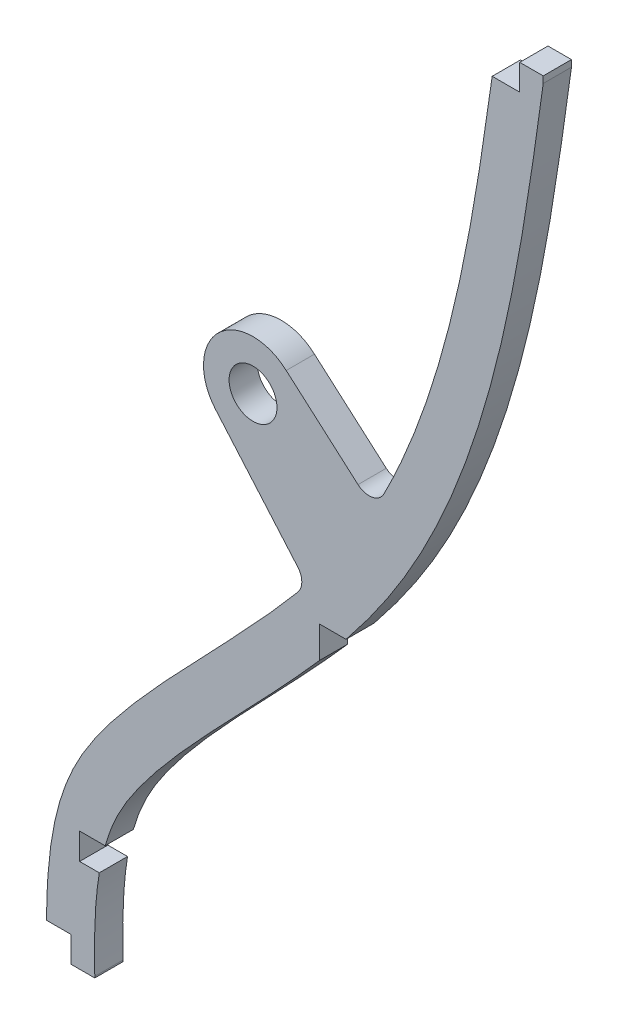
ISO-10303-21;
HEADER;
FILE_DESCRIPTION(('STEP AP214'),'2;1');
FILE_NAME('part.step','',(''),(''),'','','');
FILE_SCHEMA(('AUTOMOTIVE_DESIGN { 1 0 10303 214 1 1 1 1 }'));
ENDSEC;
DATA;
#1=APPLICATION_CONTEXT('core data for automotive mechanical design processes');
#2=APPLICATION_PROTOCOL_DEFINITION('international standard','automotive_design',2000,#1);
#3=PRODUCT_CONTEXT('',#1,'mechanical');
#4=PRODUCT('Part','Part','',(#3));
#5=PRODUCT_RELATED_PRODUCT_CATEGORY('part','',(#4));
#6=PRODUCT_DEFINITION_FORMATION('','',#4);
#7=PRODUCT_DEFINITION_CONTEXT('part definition',#1,'design');
#8=PRODUCT_DEFINITION('design','',#6,#7);
#9=PRODUCT_DEFINITION_SHAPE('','',#8);
#10=(LENGTH_UNIT() NAMED_UNIT(*) SI_UNIT(.MILLI.,.METRE.));
#11=(NAMED_UNIT(*) PLANE_ANGLE_UNIT() SI_UNIT($,.RADIAN.));
#12=(NAMED_UNIT(*) SI_UNIT($,.STERADIAN.) SOLID_ANGLE_UNIT());
#13=UNCERTAINTY_MEASURE_WITH_UNIT(LENGTH_MEASURE(1.E-05),#10,'distance_accuracy_value','');
#14=(GEOMETRIC_REPRESENTATION_CONTEXT(3) GLOBAL_UNCERTAINTY_ASSIGNED_CONTEXT((#13)) GLOBAL_UNIT_ASSIGNED_CONTEXT((#10,
#11,#12)) REPRESENTATION_CONTEXT('',''));
#15=CARTESIAN_POINT('',(0.,0.,0.));
#16=DIRECTION('',(0.,0.,1.));
#17=DIRECTION('',(1.,0.,0.));
#18=AXIS2_PLACEMENT_3D('',#15,#16,#17);
#19=CARTESIAN_POINT('',(-28.575,106.68,2.9972));
#20=CARTESIAN_POINT('',(-31.1223322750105,88.3122925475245,2.9972));
#21=CARTESIAN_POINT('',(-35.6949869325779,54.9592886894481,2.9972));
#22=CARTESIAN_POINT('',(-70.4253531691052,26.7634785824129,2.9972));
#23=CARTESIAN_POINT('',(-76.5696549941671,12.326423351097,2.9972));
#24=CARTESIAN_POINT('',(-76.2,0.,2.9972));
#25=B_SPLINE_CURVE_WITH_KNOTS('',3,(#19,#20,#21,#22,#23,#24),.UNSPECIFIED.,.F.,.F.,(4,1,1,4),
(0.,0.473853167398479,0.807071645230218,1.),.UNSPECIFIED.);
#26=DIRECTION('',(0.,0.,-1.));
#27=VECTOR('',#26,1.);
#28=SURFACE_OF_LINEAR_EXTRUSION('',#25,#27);
#29=CARTESIAN_POINT('',(-28.575,106.68,0.));
#30=CARTESIAN_POINT('',(-31.1223322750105,88.3122925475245,0.));
#31=CARTESIAN_POINT('',(-35.6949869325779,54.9592886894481,0.));
#32=CARTESIAN_POINT('',(-70.4253531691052,26.7634785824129,0.));
#33=CARTESIAN_POINT('',(-76.5696549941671,12.326423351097,0.));
#34=CARTESIAN_POINT('',(-76.2,0.,0.));
#35=B_SPLINE_CURVE_WITH_KNOTS('',3,(#29,#30,#31,#32,#33,#34),.UNSPECIFIED.,.F.,.F.,(4,1,1,4),
(0.,0.473853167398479,0.807071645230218,1.),.UNSPECIFIED.);
#36=CARTESIAN_POINT('',(-28.9562663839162,103.9368,0.));
#37=VERTEX_POINT('',#36);
#38=CARTESIAN_POINT('',(-40.4376055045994,59.8291686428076,0.));
#39=VERTEX_POINT('',#38);
#40=EDGE_CURVE('E351',#37,#39,#35,.T.);
#41=ORIENTED_EDGE('',*,*,#40,.T.);
#42=DIRECTION('',(0.,0.,-1.));
#43=VECTOR('',#42,1.);
#44=CARTESIAN_POINT('',(-40.4376055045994,59.8291686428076,0.));
#45=LINE('',#44,#43);
#46=CARTESIAN_POINT('',(-40.4376055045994,59.8291686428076,2.9972));
#47=VERTEX_POINT('',#46);
#48=EDGE_CURVE('E354',#39,#47,#45,.F.);
#49=ORIENTED_EDGE('',*,*,#48,.T.);
#50=CARTESIAN_POINT('',(-28.9562663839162,103.9368,2.9972));
#51=VERTEX_POINT('',#50);
#52=EDGE_CURVE('E306',#51,#47,#25,.T.);
#53=ORIENTED_EDGE('',*,*,#52,.F.);
#54=DIRECTION('',(0.,0.,1.));
#55=VECTOR('',#54,1.);
#56=CARTESIAN_POINT('',(-28.9562663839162,103.9368,0.));
#57=LINE('',#56,#55);
#58=EDGE_CURVE('E232',#37,#51,#57,.T.);
#59=ORIENTED_EDGE('',*,*,#58,.F.);
#60=EDGE_LOOP('',(#41,#49,#53,#59));
#61=FACE_BOUND('',#60,.T.);
#62=ADVANCED_FACE('F33',(#61),#28,.F.);
#63=CARTESIAN_POINT('',(-71.12228275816,0.152274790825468,2.9972));
#64=CARTESIAN_POINT('',(-71.1360709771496,0.612053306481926,2.9972));
#65=CARTESIAN_POINT('',(-71.1567058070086,1.54979316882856,2.9972));
#66=CARTESIAN_POINT('',(-71.1645984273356,3.28211812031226,2.9972));
#67=CARTESIAN_POINT('',(-71.1167972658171,5.2861742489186,2.9972));
#68=CARTESIAN_POINT('',(-70.9730711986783,7.42161548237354,2.9972));
#69=CARTESIAN_POINT('',(-70.6767068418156,9.95097976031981,2.9972));
#70=CARTESIAN_POINT('',(-70.1305550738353,12.5718264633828,2.9972));
#71=CARTESIAN_POINT('',(-69.2453812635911,15.104636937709,2.9972));
#72=CARTESIAN_POINT('',(-68.1202374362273,17.3343932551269,2.9972));
#73=CARTESIAN_POINT('',(-66.672184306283,19.5510756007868,2.9972));
#74=CARTESIAN_POINT('',(-64.8630643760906,21.9349302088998,2.9972));
#75=CARTESIAN_POINT('',(-62.1184326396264,25.2082421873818,2.9972));
#76=CARTESIAN_POINT('',(-58.1371910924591,29.5028468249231,2.9972));
#77=CARTESIAN_POINT('',(-52.8597313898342,34.9642275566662,2.9972));
#78=CARTESIAN_POINT('',(-47.4482093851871,40.7915416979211,2.9972));
#79=CARTESIAN_POINT('',(-42.2515146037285,47.0604507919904,2.9972));
#80=CARTESIAN_POINT('',(-37.6918324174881,53.925317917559,2.9972));
#81=CARTESIAN_POINT('',(-34.0642333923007,61.0843459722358,2.9972));
#82=CARTESIAN_POINT('',(-31.169794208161,68.4657942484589,2.9972));
#83=CARTESIAN_POINT('',(-28.9001236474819,75.9824768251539,2.9972));
#84=CARTESIAN_POINT('',(-27.1227122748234,83.5631378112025,2.9972));
#85=CARTESIAN_POINT('',(-25.7154204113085,91.1411224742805,2.9972));
#86=CARTESIAN_POINT('',(-24.7522109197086,97.3940158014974,2.9972));
#87=CARTESIAN_POINT('',(-24.0485885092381,102.335722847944,2.9972));
#88=CARTESIAN_POINT('',(-23.7122461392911,104.762949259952,2.9972));
#89=CARTESIAN_POINT('',(-23.5431598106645,105.98215738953,2.9972));
#90=B_SPLINE_CURVE_WITH_KNOTS('',3,(#63,#64,#65,#66,#67,#68,#69,#70,#71,#72,#73,#74,#75,#76,#77,
#78,#79,#80,#81,#82,#83,#84,#85,#86,#87,#88,#89),.UNSPECIFIED.,.F.,.F.,(4,1,1,1,1,1,1,1,1,1,1,1,
1,1,1,1,1,1,1,1,1,1,1,1,4),(0.,0.0078125,0.015625,0.03125,0.046875,0.0625,0.09375,0.125,0.15625,
0.1875,0.21875,0.25,0.3125,0.375,0.4375,0.5,0.5625,0.625,0.6875,0.75,0.8125,0.875,0.9375,
0.96875,1.),.UNSPECIFIED.);
#91=DIRECTION('',(0.,0.,-1.));
#92=VECTOR('',#91,1.);
#93=SURFACE_OF_LINEAR_EXTRUSION('',#90,#92);
#94=CARTESIAN_POINT('',(-71.12228275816,0.152274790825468,0.));
#95=CARTESIAN_POINT('',(-71.1360709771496,0.612053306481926,0.));
#96=CARTESIAN_POINT('',(-71.1567058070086,1.54979316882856,0.));
#97=CARTESIAN_POINT('',(-71.1645984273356,3.28211812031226,0.));
#98=CARTESIAN_POINT('',(-71.1167972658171,5.2861742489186,0.));
#99=CARTESIAN_POINT('',(-70.9730711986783,7.42161548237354,0.));
#100=CARTESIAN_POINT('',(-70.6767068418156,9.95097976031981,0.));
#101=CARTESIAN_POINT('',(-70.1305550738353,12.5718264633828,0.));
#102=CARTESIAN_POINT('',(-69.2453812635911,15.104636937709,0.));
#103=CARTESIAN_POINT('',(-68.1202374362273,17.3343932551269,0.));
#104=CARTESIAN_POINT('',(-66.672184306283,19.5510756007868,0.));
#105=CARTESIAN_POINT('',(-64.8630643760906,21.9349302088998,0.));
#106=CARTESIAN_POINT('',(-62.1184326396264,25.2082421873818,0.));
#107=CARTESIAN_POINT('',(-58.1371910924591,29.5028468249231,0.));
#108=CARTESIAN_POINT('',(-52.8597313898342,34.9642275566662,0.));
#109=CARTESIAN_POINT('',(-47.4482093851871,40.7915416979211,0.));
#110=CARTESIAN_POINT('',(-42.2515146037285,47.0604507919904,0.));
#111=CARTESIAN_POINT('',(-37.6918324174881,53.925317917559,0.));
#112=CARTESIAN_POINT('',(-34.0642333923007,61.0843459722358,0.));
#113=CARTESIAN_POINT('',(-31.169794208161,68.4657942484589,0.));
#114=CARTESIAN_POINT('',(-28.9001236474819,75.9824768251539,0.));
#115=CARTESIAN_POINT('',(-27.1227122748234,83.5631378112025,0.));
#116=CARTESIAN_POINT('',(-25.7154204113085,91.1411224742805,0.));
#117=CARTESIAN_POINT('',(-24.7522109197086,97.3940158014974,0.));
#118=CARTESIAN_POINT('',(-24.0485885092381,102.335722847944,0.));
#119=CARTESIAN_POINT('',(-23.7122461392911,104.762949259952,0.));
#120=CARTESIAN_POINT('',(-23.5431598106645,105.98215738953,0.));
#121=B_SPLINE_CURVE_WITH_KNOTS('',3,(#94,#95,#96,#97,#98,#99,#100,#101,#102,#103,#104,#105,#106,
#107,#108,#109,#110,#111,#112,#113,#114,#115,#116,#117,#118,#119,#120),.UNSPECIFIED.,.F.,.F.,(4,
1,1,1,1,1,1,1,1,1,1,1,1,1,1,1,1,1,1,1,1,1,1,1,4),(0.,0.0078125,0.015625,0.03125,0.046875,0.0625,
0.09375,0.125,0.15625,0.1875,0.21875,0.25,0.3125,0.375,0.4375,0.5,0.5625,0.625,0.6875,0.75,
0.8125,0.875,0.9375,0.96875,1.),.UNSPECIFIED.);
#122=CARTESIAN_POINT('',(-70.0284766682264,12.7,0.));
#123=VERTEX_POINT('',#122);
#124=CARTESIAN_POINT('',(-47.2876316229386,41.0895462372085,0.));
#125=VERTEX_POINT('',#124);
#126=EDGE_CURVE('E398',#123,#125,#121,.T.);
#127=ORIENTED_EDGE('',*,*,#126,.T.);
#128=DIRECTION('',(0.,0.,1.));
#129=VECTOR('',#128,1.);
#130=CARTESIAN_POINT('',(-47.2876316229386,41.0895462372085,0.));
#131=LINE('',#130,#129);
#132=CARTESIAN_POINT('',(-47.2876316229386,41.0895462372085,2.9972));
#133=VERTEX_POINT('',#132);
#134=EDGE_CURVE('E254',#125,#133,#131,.T.);
#135=ORIENTED_EDGE('',*,*,#134,.T.);
#136=CARTESIAN_POINT('',(-70.0284766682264,12.7,2.9972));
#137=VERTEX_POINT('',#136);
#138=EDGE_CURVE('E420',#137,#133,#90,.T.);
#139=ORIENTED_EDGE('',*,*,#138,.F.);
#140=DIRECTION('',(0.,0.,1.));
#141=VECTOR('',#140,1.);
#142=CARTESIAN_POINT('',(-70.0284766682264,12.7,0.));
#143=LINE('',#142,#141);
#144=EDGE_CURVE('E271',#123,#137,#143,.T.);
#145=ORIENTED_EDGE('',*,*,#144,.F.);
#146=EDGE_LOOP('',(#127,#135,#139,#145));
#147=FACE_BOUND('',#146,.T.);
#148=ADVANCED_FACE('F338',(#147),#93,.F.);
#149=CARTESIAN_POINT('',(-71.12228275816,0.152274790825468,0.));
#150=VERTEX_POINT('',#149);
#151=CARTESIAN_POINT('',(-70.6430311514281,9.90599999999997,0.));
#152=VERTEX_POINT('',#151);
#153=EDGE_CURVE('E393',#150,#152,#121,.T.);
#154=ORIENTED_EDGE('',*,*,#153,.T.);
#155=DIRECTION('',(0.,0.,1.));
#156=VECTOR('',#155,1.);
#157=CARTESIAN_POINT('',(-70.6430311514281,9.90599999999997,0.));
#158=LINE('',#157,#156);
#159=CARTESIAN_POINT('',(-70.6430311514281,9.90599999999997,2.9972));
#160=VERTEX_POINT('',#159);
#161=EDGE_CURVE('E278',#152,#160,#158,.T.);
#162=ORIENTED_EDGE('',*,*,#161,.T.);
#163=CARTESIAN_POINT('',(-71.12228275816,0.152274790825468,2.9972));
#164=VERTEX_POINT('',#163);
#165=EDGE_CURVE('E415',#164,#160,#90,.T.);
#166=ORIENTED_EDGE('',*,*,#165,.F.);
#167=DIRECTION('',(0.,0.,-1.));
#168=VECTOR('',#167,1.);
#169=CARTESIAN_POINT('',(-71.12228275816,0.152274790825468,2.9972));
#170=LINE('',#169,#168);
#171=EDGE_CURVE('E377',#164,#150,#170,.T.);
#172=ORIENTED_EDGE('',*,*,#171,.T.);
#173=EDGE_LOOP('',(#154,#162,#166,#172));
#174=FACE_BOUND('',#173,.T.);
#175=ADVANCED_FACE('F322',(#174),#93,.F.);
#176=CARTESIAN_POINT('',(-49.5715588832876,46.2348557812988,2.9972));
#177=VERTEX_POINT('',#176);
#178=CARTESIAN_POINT('',(-76.239147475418,2.74319999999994,2.9972));
#179=VERTEX_POINT('',#178);
#180=EDGE_CURVE('E312',#177,#179,#25,.T.);
#181=ORIENTED_EDGE('',*,*,#180,.F.);
#182=DIRECTION('',(0.,0.,-1.));
#183=VECTOR('',#182,1.);
#184=CARTESIAN_POINT('',(-49.5715588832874,46.2348557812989,2.9972));
#185=LINE('',#184,#183);
#186=CARTESIAN_POINT('',(-49.5715588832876,46.2348557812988,0.));
#187=VERTEX_POINT('',#186);
#188=EDGE_CURVE('E361',#177,#187,#185,.T.);
#189=ORIENTED_EDGE('',*,*,#188,.T.);
#190=CARTESIAN_POINT('',(-76.239147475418,2.74319999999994,0.));
#191=VERTEX_POINT('',#190);
#192=EDGE_CURVE('E302',#187,#191,#35,.T.);
#193=ORIENTED_EDGE('',*,*,#192,.T.);
#194=DIRECTION('',(0.,0.,1.));
#195=VECTOR('',#194,1.);
#196=CARTESIAN_POINT('',(-76.239147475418,2.74319999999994,0.));
#197=LINE('',#196,#195);
#198=EDGE_CURVE('E299',#191,#179,#197,.T.);
#199=ORIENTED_EDGE('',*,*,#198,.T.);
#200=EDGE_LOOP('',(#181,#189,#193,#199));
#201=FACE_BOUND('',#200,.T.);
#202=ADVANCED_FACE('F318',(#201),#28,.F.);
#203=CARTESIAN_POINT('',(-71.1222823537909,0.,2.9972));
#204=DIRECTION('',(0.,1.,0.));
#205=DIRECTION('',(-1.,0.,0.));
#206=AXIS2_PLACEMENT_3D('',#203,#204,#205);
#207=PLANE('',#206);
#208=DIRECTION('',(1.,0.,0.));
#209=VECTOR('',#208,1.);
#210=CARTESIAN_POINT('',(-71.1222823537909,0.,2.9972));
#211=LINE('',#210,#209);
#212=CARTESIAN_POINT('',(-73.66,0.,2.9972));
#213=VERTEX_POINT('',#212);
#214=CARTESIAN_POINT('',(-71.1222823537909,0.,2.9972));
#215=VERTEX_POINT('',#214);
#216=EDGE_CURVE('E311',#213,#215,#211,.T.);
#217=ORIENTED_EDGE('',*,*,#216,.F.);
#218=DIRECTION('',(0.,0.,1.));
#219=VECTOR('',#218,1.);
#220=CARTESIAN_POINT('',(-73.66,0.,0.));
#221=LINE('',#220,#219);
#222=CARTESIAN_POINT('',(-73.66,0.,0.));
#223=VERTEX_POINT('',#222);
#224=EDGE_CURVE('E294',#223,#213,#221,.T.);
#225=ORIENTED_EDGE('',*,*,#224,.F.);
#226=DIRECTION('',(1.,0.,0.));
#227=VECTOR('',#226,1.);
#228=CARTESIAN_POINT('',(-71.1222823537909,0.,0.));
#229=LINE('',#228,#227);
#230=CARTESIAN_POINT('',(-71.1222823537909,0.,0.));
#231=VERTEX_POINT('',#230);
#232=EDGE_CURVE('E355',#223,#231,#229,.T.);
#233=ORIENTED_EDGE('',*,*,#232,.T.);
#234=DIRECTION('',(0.,0.,-1.));
#235=VECTOR('',#234,1.);
#236=CARTESIAN_POINT('',(-71.1222823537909,0.,2.9972));
#237=LINE('',#236,#235);
#238=EDGE_CURVE('E375',#215,#231,#237,.T.);
#239=ORIENTED_EDGE('',*,*,#238,.F.);
#240=EDGE_LOOP('',(#217,#225,#233,#239));
#241=FACE_BOUND('',#240,.T.);
#242=ADVANCED_FACE('F321',(#241),#207,.F.);
#243=CARTESIAN_POINT('',(-71.12228275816,0.152274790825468,2.9972));
#244=DIRECTION('',(-0.999999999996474,-2.65552242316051E-06,0.));
#245=DIRECTION('',(2.65552242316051E-06,-0.999999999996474,0.));
#246=AXIS2_PLACEMENT_3D('',#243,#244,#245);
#247=PLANE('',#246);
#248=DIRECTION('',(-2.65552242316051E-06,0.999999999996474,0.));
#249=VECTOR('',#248,1.);
#250=CARTESIAN_POINT('',(-71.12228275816,0.152274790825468,0.));
#251=LINE('',#250,#249);
#252=EDGE_CURVE('E400',#231,#150,#251,.T.);
#253=ORIENTED_EDGE('',*,*,#252,.T.);
#254=ORIENTED_EDGE('',*,*,#171,.F.);
#255=DIRECTION('',(-2.65552242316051E-06,0.999999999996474,0.));
#256=VECTOR('',#255,1.);
#257=CARTESIAN_POINT('',(-71.12228275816,0.152274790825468,2.9972));
#258=LINE('',#257,#256);
#259=EDGE_CURVE('E422',#215,#164,#258,.T.);
#260=ORIENTED_EDGE('',*,*,#259,.F.);
#261=ORIENTED_EDGE('',*,*,#238,.T.);
#262=EDGE_LOOP('',(#253,#254,#260,#261));
#263=FACE_BOUND('',#262,.T.);
#264=ADVANCED_FACE('F429',(#263),#247,.F.);
#265=CARTESIAN_POINT('',(-44.459383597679,44.45,2.9972));
#266=VERTEX_POINT('',#265);
#267=CARTESIAN_POINT('',(-23.5431598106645,105.98215738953,2.9972));
#268=VERTEX_POINT('',#267);
#269=EDGE_CURVE('E421',#266,#268,#90,.T.);
#270=ORIENTED_EDGE('',*,*,#269,.F.);
#271=DIRECTION('',(0.,0.,1.));
#272=VECTOR('',#271,1.);
#273=CARTESIAN_POINT('',(-44.459383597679,44.45,0.));
#274=LINE('',#273,#272);
#275=CARTESIAN_POINT('',(-44.459383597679,44.45,0.));
#276=VERTEX_POINT('',#275);
#277=EDGE_CURVE('E250',#276,#266,#274,.T.);
#278=ORIENTED_EDGE('',*,*,#277,.F.);
#279=CARTESIAN_POINT('',(-23.5431598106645,105.98215738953,0.));
#280=VERTEX_POINT('',#279);
#281=EDGE_CURVE('E399',#276,#280,#121,.T.);
#282=ORIENTED_EDGE('',*,*,#281,.T.);
#283=DIRECTION('',(0.,0.,-1.));
#284=VECTOR('',#283,1.);
#285=CARTESIAN_POINT('',(-23.5431598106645,105.98215738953,2.9972));
#286=LINE('',#285,#284);
#287=EDGE_CURVE('E382',#268,#280,#286,.T.);
#288=ORIENTED_EDGE('',*,*,#287,.F.);
#289=EDGE_LOOP('',(#270,#278,#282,#288));
#290=FACE_BOUND('',#289,.T.);
#291=ADVANCED_FACE('F346',(#290),#93,.F.);
#292=CARTESIAN_POINT('',(-23.5431598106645,105.98215738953,2.9972));
#293=DIRECTION('',(-1.,0.,0.));
#294=DIRECTION('',(0.,0.,1.));
#295=AXIS2_PLACEMENT_3D('',#292,#293,#294);
#296=PLANE('',#295);
#297=DIRECTION('',(0.,1.,0.));
#298=VECTOR('',#297,1.);
#299=CARTESIAN_POINT('',(-23.5431598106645,105.98215738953,0.));
#300=LINE('',#299,#298);
#301=CARTESIAN_POINT('',(-23.5431598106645,106.68,0.));
#302=VERTEX_POINT('',#301);
#303=EDGE_CURVE('E391',#280,#302,#300,.T.);
#304=ORIENTED_EDGE('',*,*,#303,.T.);
#305=DIRECTION('',(0.,0.,-1.));
#306=VECTOR('',#305,1.);
#307=CARTESIAN_POINT('',(-23.5431598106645,106.68,2.9972));
#308=LINE('',#307,#306);
#309=CARTESIAN_POINT('',(-23.5431598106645,106.68,2.9972));
#310=VERTEX_POINT('',#309);
#311=EDGE_CURVE('E385',#310,#302,#308,.T.);
#312=ORIENTED_EDGE('',*,*,#311,.F.);
#313=DIRECTION('',(0.,1.,0.));
#314=VECTOR('',#313,1.);
#315=CARTESIAN_POINT('',(-23.5431598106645,105.98215738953,2.9972));
#316=LINE('',#315,#314);
#317=EDGE_CURVE('E413',#268,#310,#316,.T.);
#318=ORIENTED_EDGE('',*,*,#317,.F.);
#319=ORIENTED_EDGE('',*,*,#287,.T.);
#320=EDGE_LOOP('',(#304,#312,#318,#319));
#321=FACE_BOUND('',#320,.T.);
#322=ADVANCED_FACE('F428',(#321),#296,.F.);
#323=CARTESIAN_POINT('',(-28.575,106.68,2.9972));
#324=DIRECTION('',(0.,-1.,0.));
#325=DIRECTION('',(0.,0.,-1.));
#326=AXIS2_PLACEMENT_3D('',#323,#324,#325);
#327=PLANE('',#326);
#328=DIRECTION('',(-1.,0.,0.));
#329=VECTOR('',#328,1.);
#330=CARTESIAN_POINT('',(-28.575,106.68,0.));
#331=LINE('',#330,#329);
#332=CARTESIAN_POINT('',(-26.035,106.68,0.));
#333=VERTEX_POINT('',#332);
#334=EDGE_CURVE('E374',#302,#333,#331,.T.);
#335=ORIENTED_EDGE('',*,*,#334,.T.);
#336=DIRECTION('',(0.,0.,1.));
#337=VECTOR('',#336,1.);
#338=CARTESIAN_POINT('',(-26.035,106.68,0.));
#339=LINE('',#338,#337);
#340=CARTESIAN_POINT('',(-26.035,106.68,2.9972));
#341=VERTEX_POINT('',#340);
#342=EDGE_CURVE('E236',#333,#341,#339,.T.);
#343=ORIENTED_EDGE('',*,*,#342,.T.);
#344=DIRECTION('',(-1.,0.,0.));
#345=VECTOR('',#344,1.);
#346=CARTESIAN_POINT('',(-28.575,106.68,2.9972));
#347=LINE('',#346,#345);
#348=EDGE_CURVE('E388',#310,#341,#347,.T.);
#349=ORIENTED_EDGE('',*,*,#348,.F.);
#350=ORIENTED_EDGE('',*,*,#311,.T.);
#351=EDGE_LOOP('',(#335,#343,#349,#350));
#352=FACE_BOUND('',#351,.T.);
#353=ADVANCED_FACE('F478',(#352),#327,.F.);
#354=CARTESIAN_POINT('',(-46.430466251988,50.1960313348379,2.9972));
#355=DIRECTION('',(0.,0.,1.));
#356=DIRECTION('',(1.,0.,0.));
#357=AXIS2_PLACEMENT_3D('',#354,#355,#356);
#358=PLANE('',#357);
#359=ORIENTED_EDGE('',*,*,#52,.T.);
#360=CARTESIAN_POINT('',(-42.0207648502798,60.6384216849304,2.9972));
#361=DIRECTION('',(0.,0.,1.));
#362=DIRECTION('',(1.,0.,0.));
#363=AXIS2_PLACEMENT_3D('',#360,#361,#362);
#364=CIRCLE('',#363,1.778);
#365=CARTESIAN_POINT('',(-43.1927780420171,59.3013842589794,2.9972));
#366=VERTEX_POINT('',#365);
#367=EDGE_CURVE('E41',#47,#366,#364,.F.);
#368=ORIENTED_EDGE('',*,*,#367,.T.);
#369=DIRECTION('',(-0.751989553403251,0.659175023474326,0.));
#370=VECTOR('',#369,1.);
#371=CARTESIAN_POINT('',(-39.0309458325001,55.6532274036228,2.9972));
#372=LINE('',#371,#370);
#373=CARTESIAN_POINT('',(-50.8086045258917,65.9772251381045,2.9972));
#374=VERTEX_POINT('',#373);
#375=EDGE_CURVE('E211',#366,#374,#372,.T.);
#376=ORIENTED_EDGE('',*,*,#375,.T.);
#377=CARTESIAN_POINT('',(-54.3317843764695,62.0810371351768,2.9972));
#378=DIRECTION('',(0.,0.,1.));
#379=DIRECTION('',(-1.,0.,0.));
#380=AXIS2_PLACEMENT_3D('',#377,#378,#379);
#381=CIRCLE('',#380,5.25291130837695);
#382=CARTESIAN_POINT('',(-58.3361305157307,58.6812887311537,2.9972));
#383=VERTEX_POINT('',#382);
#384=EDGE_CURVE('E219',#374,#383,#381,.T.);
#385=ORIENTED_EDGE('',*,*,#384,.T.);
#386=DIRECTION('',(0.653074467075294,-0.757293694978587,0.));
#387=VECTOR('',#386,1.);
#388=CARTESIAN_POINT('',(-58.3361305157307,58.6812887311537,2.9972));
#389=LINE('',#388,#387);
#390=CARTESIAN_POINT('',(-49.5883128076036,48.5374727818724,2.9972));
#391=VERTEX_POINT('',#390);
#392=EDGE_CURVE('E192',#383,#391,#389,.T.);
#393=ORIENTED_EDGE('',*,*,#392,.T.);
#394=CARTESIAN_POINT('',(-50.9347809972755,47.3763063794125,2.9972));
#395=DIRECTION('',(0.,0.,1.));
#396=DIRECTION('',(1.,0.,0.));
#397=AXIS2_PLACEMENT_3D('',#394,#395,#396);
#398=CIRCLE('',#397,1.778);
#399=EDGE_CURVE('E366',#391,#177,#398,.F.);
#400=ORIENTED_EDGE('',*,*,#399,.T.);
#401=ORIENTED_EDGE('',*,*,#180,.T.);
#402=DIRECTION('',(-1.,0.,0.));
#403=VECTOR('',#402,1.);
#404=CARTESIAN_POINT('',(-73.66,2.7432,2.9972));
#405=LINE('',#404,#403);
#406=CARTESIAN_POINT('',(-73.66,2.7432,2.9972));
#407=VERTEX_POINT('',#406);
#408=EDGE_CURVE('E291',#407,#179,#405,.T.);
#409=ORIENTED_EDGE('',*,*,#408,.F.);
#410=DIRECTION('',(0.,1.,0.));
#411=VECTOR('',#410,1.);
#412=CARTESIAN_POINT('',(-73.66,0.,2.9972));
#413=LINE('',#412,#411);
#414=EDGE_CURVE('E281',#213,#407,#413,.T.);
#415=ORIENTED_EDGE('',*,*,#414,.F.);
#416=ORIENTED_EDGE('',*,*,#216,.T.);
#417=ORIENTED_EDGE('',*,*,#259,.T.);
#418=ORIENTED_EDGE('',*,*,#165,.T.);
#419=DIRECTION('',(1.,0.,0.));
#420=VECTOR('',#419,1.);
#421=CARTESIAN_POINT('',(-72.7299662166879,9.906,2.9972));
#422=LINE('',#421,#420);
#423=CARTESIAN_POINT('',(-72.7299662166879,9.906,2.9972));
#424=VERTEX_POINT('',#423);
#425=EDGE_CURVE('E265',#424,#160,#422,.T.);
#426=ORIENTED_EDGE('',*,*,#425,.F.);
#427=DIRECTION('',(0.,-1.,0.));
#428=VECTOR('',#427,1.);
#429=CARTESIAN_POINT('',(-72.7299662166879,12.7,2.9972));
#430=LINE('',#429,#428);
#431=CARTESIAN_POINT('',(-72.7299662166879,12.7,2.9972));
#432=VERTEX_POINT('',#431);
#433=EDGE_CURVE('E274',#432,#424,#430,.T.);
#434=ORIENTED_EDGE('',*,*,#433,.F.);
#435=DIRECTION('',(-1.,0.,0.));
#436=VECTOR('',#435,1.);
#437=CARTESIAN_POINT('',(-70.0284766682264,12.7,2.9972));
#438=LINE('',#437,#436);
#439=EDGE_CURVE('E257',#137,#432,#438,.T.);
#440=ORIENTED_EDGE('',*,*,#439,.F.);
#441=ORIENTED_EDGE('',*,*,#138,.T.);
#442=DIRECTION('',(0.,-1.,0.));
#443=VECTOR('',#442,1.);
#444=CARTESIAN_POINT('',(-47.2876316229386,44.45,2.9972));
#445=LINE('',#444,#443);
#446=CARTESIAN_POINT('',(-47.2876316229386,44.45,2.9972));
#447=VERTEX_POINT('',#446);
#448=EDGE_CURVE('E247',#447,#133,#445,.T.);
#449=ORIENTED_EDGE('',*,*,#448,.F.);
#450=DIRECTION('',(-1.,0.,0.));
#451=VECTOR('',#450,1.);
#452=CARTESIAN_POINT('',(-44.459383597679,44.45,2.9972));
#453=LINE('',#452,#451);
#454=EDGE_CURVE('E239',#266,#447,#453,.T.);
#455=ORIENTED_EDGE('',*,*,#454,.F.);
#456=ORIENTED_EDGE('',*,*,#269,.T.);
#457=ORIENTED_EDGE('',*,*,#317,.T.);
#458=ORIENTED_EDGE('',*,*,#348,.T.);
#459=DIRECTION('',(0.,1.,0.));
#460=VECTOR('',#459,1.);
#461=CARTESIAN_POINT('',(-26.035,106.68,2.9972));
#462=LINE('',#461,#460);
#463=CARTESIAN_POINT('',(-26.035,103.9368,2.9972));
#464=VERTEX_POINT('',#463);
#465=EDGE_CURVE('E229',#464,#341,#462,.T.);
#466=ORIENTED_EDGE('',*,*,#465,.F.);
#467=DIRECTION('',(1.,0.,0.));
#468=VECTOR('',#467,1.);
#469=CARTESIAN_POINT('',(-26.035,103.9368,2.9972));
#470=LINE('',#469,#468);
#471=EDGE_CURVE('E223',#51,#464,#470,.T.);
#472=ORIENTED_EDGE('',*,*,#471,.F.);
#473=EDGE_LOOP('',(#359,#368,#376,#385,#393,#400,#401,#409,#415,#416,#417,#418,#426,#434,#440,
#441,#449,#455,#456,#457,#458,#466,#472));
#474=FACE_BOUND('',#473,.T.);
#475=CARTESIAN_POINT('',(-54.3317843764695,62.0810371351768,2.9972));
#476=DIRECTION('',(0.,0.,1.));
#477=DIRECTION('',(1.,0.,0.));
#478=AXIS2_PLACEMENT_3D('',#475,#476,#477);
#479=CIRCLE('',#478,2.54);
#480=CARTESIAN_POINT('',(-51.7917843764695,62.0810371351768,2.9972));
#481=VERTEX_POINT('',#480);
#482=EDGE_CURVE('E215',#481,#481,#479,.T.);
#483=ORIENTED_EDGE('',*,*,#482,.F.);
#484=EDGE_LOOP('',(#483));
#485=FACE_BOUND('',#484,.T.);
#486=ADVANCED_FACE('F368',(#474,#485),#358,.T.);
#487=CARTESIAN_POINT('',(-46.430466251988,50.1960313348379,0.));
#488=DIRECTION('',(0.,0.,1.));
#489=DIRECTION('',(1.,0.,0.));
#490=AXIS2_PLACEMENT_3D('',#487,#488,#489);
#491=PLANE('',#490);
#492=ORIENTED_EDGE('',*,*,#192,.F.);
#493=CARTESIAN_POINT('',(-50.9347809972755,47.3763063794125,0.));
#494=DIRECTION('',(0.,0.,1.));
#495=DIRECTION('',(1.,0.,0.));
#496=AXIS2_PLACEMENT_3D('',#493,#494,#495);
#497=CIRCLE('',#496,1.778);
#498=CARTESIAN_POINT('',(-49.5883128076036,48.5374727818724,0.));
#499=VERTEX_POINT('',#498);
#500=EDGE_CURVE('E206',#187,#499,#497,.T.);
#501=ORIENTED_EDGE('',*,*,#500,.T.);
#502=DIRECTION('',(0.653074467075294,-0.757293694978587,0.));
#503=VECTOR('',#502,1.);
#504=CARTESIAN_POINT('',(-58.3361305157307,58.6812887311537,0.));
#505=LINE('',#504,#503);
#506=CARTESIAN_POINT('',(-58.3361305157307,58.6812887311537,0.));
#507=VERTEX_POINT('',#506);
#508=EDGE_CURVE('E189',#507,#499,#505,.T.);
#509=ORIENTED_EDGE('',*,*,#508,.F.);
#510=CARTESIAN_POINT('',(-54.3317843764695,62.0810371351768,0.));
#511=DIRECTION('',(0.,0.,1.));
#512=DIRECTION('',(-1.,0.,0.));
#513=AXIS2_PLACEMENT_3D('',#510,#511,#512);
#514=CIRCLE('',#513,5.25291130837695);
#515=CARTESIAN_POINT('',(-50.8086045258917,65.9772251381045,0.));
#516=VERTEX_POINT('',#515);
#517=EDGE_CURVE('E205',#516,#507,#514,.T.);
#518=ORIENTED_EDGE('',*,*,#517,.F.);
#519=DIRECTION('',(-0.751989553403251,0.659175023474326,0.));
#520=VECTOR('',#519,1.);
#521=CARTESIAN_POINT('',(-39.0309458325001,55.6532274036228,0.));
#522=LINE('',#521,#520);
#523=CARTESIAN_POINT('',(-43.1927780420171,59.3013842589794,0.));
#524=VERTEX_POINT('',#523);
#525=EDGE_CURVE('E198',#524,#516,#522,.T.);
#526=ORIENTED_EDGE('',*,*,#525,.F.);
#527=CARTESIAN_POINT('',(-42.0207648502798,60.6384216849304,0.));
#528=DIRECTION('',(0.,0.,1.));
#529=DIRECTION('',(1.,0.,0.));
#530=AXIS2_PLACEMENT_3D('',#527,#528,#529);
#531=CIRCLE('',#530,1.778);
#532=EDGE_CURVE('E11',#524,#39,#531,.T.);
#533=ORIENTED_EDGE('',*,*,#532,.T.);
#534=ORIENTED_EDGE('',*,*,#40,.F.);
#535=DIRECTION('',(1.,0.,0.));
#536=VECTOR('',#535,1.);
#537=CARTESIAN_POINT('',(-26.035,103.9368,0.));
#538=LINE('',#537,#536);
#539=CARTESIAN_POINT('',(-26.035,103.9368,0.));
#540=VERTEX_POINT('',#539);
#541=EDGE_CURVE('E225',#37,#540,#538,.T.);
#542=ORIENTED_EDGE('',*,*,#541,.T.);
#543=DIRECTION('',(0.,1.,0.));
#544=VECTOR('',#543,1.);
#545=CARTESIAN_POINT('',(-26.035,106.68,0.));
#546=LINE('',#545,#544);
#547=EDGE_CURVE('E228',#540,#333,#546,.T.);
#548=ORIENTED_EDGE('',*,*,#547,.T.);
#549=ORIENTED_EDGE('',*,*,#334,.F.);
#550=ORIENTED_EDGE('',*,*,#303,.F.);
#551=ORIENTED_EDGE('',*,*,#281,.F.);
#552=DIRECTION('',(-1.,0.,0.));
#553=VECTOR('',#552,1.);
#554=CARTESIAN_POINT('',(-44.459383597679,44.45,0.));
#555=LINE('',#554,#553);
#556=CARTESIAN_POINT('',(-47.2876316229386,44.45,0.));
#557=VERTEX_POINT('',#556);
#558=EDGE_CURVE('E243',#276,#557,#555,.T.);
#559=ORIENTED_EDGE('',*,*,#558,.T.);
#560=DIRECTION('',(0.,-1.,0.));
#561=VECTOR('',#560,1.);
#562=CARTESIAN_POINT('',(-47.2876316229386,44.45,0.));
#563=LINE('',#562,#561);
#564=EDGE_CURVE('E246',#557,#125,#563,.T.);
#565=ORIENTED_EDGE('',*,*,#564,.T.);
#566=ORIENTED_EDGE('',*,*,#126,.F.);
#567=DIRECTION('',(-1.,0.,0.));
#568=VECTOR('',#567,1.);
#569=CARTESIAN_POINT('',(-70.0284766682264,12.7,0.));
#570=LINE('',#569,#568);
#571=CARTESIAN_POINT('',(-72.7299662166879,12.7,0.));
#572=VERTEX_POINT('',#571);
#573=EDGE_CURVE('E261',#123,#572,#570,.T.);
#574=ORIENTED_EDGE('',*,*,#573,.T.);
#575=DIRECTION('',(0.,-1.,0.));
#576=VECTOR('',#575,1.);
#577=CARTESIAN_POINT('',(-72.7299662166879,12.7,0.));
#578=LINE('',#577,#576);
#579=CARTESIAN_POINT('',(-72.7299662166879,9.906,0.));
#580=VERTEX_POINT('',#579);
#581=EDGE_CURVE('E264',#572,#580,#578,.T.);
#582=ORIENTED_EDGE('',*,*,#581,.T.);
#583=DIRECTION('',(1.,0.,0.));
#584=VECTOR('',#583,1.);
#585=CARTESIAN_POINT('',(-72.7299662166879,9.906,0.));
#586=LINE('',#585,#584);
#587=EDGE_CURVE('E268',#580,#152,#586,.T.);
#588=ORIENTED_EDGE('',*,*,#587,.T.);
#589=ORIENTED_EDGE('',*,*,#153,.F.);
#590=ORIENTED_EDGE('',*,*,#252,.F.);
#591=ORIENTED_EDGE('',*,*,#232,.F.);
#592=DIRECTION('',(0.,1.,0.));
#593=VECTOR('',#592,1.);
#594=CARTESIAN_POINT('',(-73.66,0.,0.));
#595=LINE('',#594,#593);
#596=CARTESIAN_POINT('',(-73.66,2.7432,0.));
#597=VERTEX_POINT('',#596);
#598=EDGE_CURVE('E287',#223,#597,#595,.T.);
#599=ORIENTED_EDGE('',*,*,#598,.T.);
#600=DIRECTION('',(-1.,0.,0.));
#601=VECTOR('',#600,1.);
#602=CARTESIAN_POINT('',(-73.66,2.7432,0.));
#603=LINE('',#602,#601);
#604=EDGE_CURVE('E290',#597,#191,#603,.T.);
#605=ORIENTED_EDGE('',*,*,#604,.T.);
#606=EDGE_LOOP('',(#492,#501,#509,#518,#526,#533,#534,#542,#548,#549,#550,#551,#559,#565,#566,
#574,#582,#588,#589,#590,#591,#599,#605));
#607=FACE_BOUND('',#606,.T.);
#608=CARTESIAN_POINT('',(-54.3317843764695,62.0810371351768,0.));
#609=DIRECTION('',(0.,0.,1.));
#610=DIRECTION('',(1.,0.,0.));
#611=AXIS2_PLACEMENT_3D('',#608,#609,#610);
#612=CIRCLE('',#611,2.54);
#613=CARTESIAN_POINT('',(-51.7917843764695,62.0810371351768,0.));
#614=VERTEX_POINT('',#613);
#615=EDGE_CURVE('E221',#614,#614,#612,.T.);
#616=ORIENTED_EDGE('',*,*,#615,.T.);
#617=EDGE_LOOP('',(#616));
#618=FACE_BOUND('',#617,.T.);
#619=ADVANCED_FACE('F203',(#607,#618),#491,.F.);
#620=CARTESIAN_POINT('',(-73.66,2.7432,0.));
#621=DIRECTION('',(0.,1.,0.));
#622=DIRECTION('',(-1.,0.,0.));
#623=AXIS2_PLACEMENT_3D('',#620,#621,#622);
#624=PLANE('',#623);
#625=ORIENTED_EDGE('',*,*,#408,.T.);
#626=ORIENTED_EDGE('',*,*,#198,.F.);
#627=ORIENTED_EDGE('',*,*,#604,.F.);
#628=DIRECTION('',(0.,0.,1.));
#629=VECTOR('',#628,1.);
#630=CARTESIAN_POINT('',(-73.66,2.7432,0.));
#631=LINE('',#630,#629);
#632=EDGE_CURVE('E303',#597,#407,#631,.T.);
#633=ORIENTED_EDGE('',*,*,#632,.T.);
#634=EDGE_LOOP('',(#625,#626,#627,#633));
#635=FACE_BOUND('',#634,.T.);
#636=ADVANCED_FACE('F512',(#635),#624,.F.);
#637=CARTESIAN_POINT('',(-73.66,0.,0.));
#638=DIRECTION('',(1.,0.,0.));
#639=DIRECTION('',(0.,0.,-1.));
#640=AXIS2_PLACEMENT_3D('',#637,#638,#639);
#641=PLANE('',#640);
#642=ORIENTED_EDGE('',*,*,#414,.T.);
#643=ORIENTED_EDGE('',*,*,#632,.F.);
#644=ORIENTED_EDGE('',*,*,#598,.F.);
#645=ORIENTED_EDGE('',*,*,#224,.T.);
#646=EDGE_LOOP('',(#642,#643,#644,#645));
#647=FACE_BOUND('',#646,.T.);
#648=ADVANCED_FACE('F505',(#647),#641,.F.);
#649=CARTESIAN_POINT('',(-72.7299662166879,9.906,0.));
#650=DIRECTION('',(0.,-1.,0.));
#651=DIRECTION('',(1.,0.,0.));
#652=AXIS2_PLACEMENT_3D('',#649,#650,#651);
#653=PLANE('',#652);
#654=ORIENTED_EDGE('',*,*,#425,.T.);
#655=ORIENTED_EDGE('',*,*,#161,.F.);
#656=ORIENTED_EDGE('',*,*,#587,.F.);
#657=DIRECTION('',(0.,0.,1.));
#658=VECTOR('',#657,1.);
#659=CARTESIAN_POINT('',(-72.7299662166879,9.906,0.));
#660=LINE('',#659,#658);
#661=EDGE_CURVE('E282',#580,#424,#660,.T.);
#662=ORIENTED_EDGE('',*,*,#661,.T.);
#663=EDGE_LOOP('',(#654,#655,#656,#662));
#664=FACE_BOUND('',#663,.T.);
#665=ADVANCED_FACE('F448',(#664),#653,.F.);
#666=CARTESIAN_POINT('',(-72.7299662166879,12.7,0.));
#667=DIRECTION('',(-1.,0.,0.));
#668=DIRECTION('',(0.,0.,1.));
#669=AXIS2_PLACEMENT_3D('',#666,#667,#668);
#670=PLANE('',#669);
#671=ORIENTED_EDGE('',*,*,#433,.T.);
#672=ORIENTED_EDGE('',*,*,#661,.F.);
#673=ORIENTED_EDGE('',*,*,#581,.F.);
#674=DIRECTION('',(0.,0.,1.));
#675=VECTOR('',#674,1.);
#676=CARTESIAN_POINT('',(-72.7299662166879,12.7,0.));
#677=LINE('',#676,#675);
#678=EDGE_CURVE('E284',#572,#432,#677,.T.);
#679=ORIENTED_EDGE('',*,*,#678,.T.);
#680=EDGE_LOOP('',(#671,#672,#673,#679));
#681=FACE_BOUND('',#680,.T.);
#682=ADVANCED_FACE('F504',(#681),#670,.F.);
#683=CARTESIAN_POINT('',(-70.0284766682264,12.7,0.));
#684=DIRECTION('',(0.,1.,0.));
#685=DIRECTION('',(0.,0.,1.));
#686=AXIS2_PLACEMENT_3D('',#683,#684,#685);
#687=PLANE('',#686);
#688=ORIENTED_EDGE('',*,*,#439,.T.);
#689=ORIENTED_EDGE('',*,*,#678,.F.);
#690=ORIENTED_EDGE('',*,*,#573,.F.);
#691=ORIENTED_EDGE('',*,*,#144,.T.);
#692=EDGE_LOOP('',(#688,#689,#690,#691));
#693=FACE_BOUND('',#692,.T.);
#694=ADVANCED_FACE('F499',(#693),#687,.F.);
#695=CARTESIAN_POINT('',(-47.2876316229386,44.45,0.));
#696=DIRECTION('',(-1.,0.,0.));
#697=DIRECTION('',(0.,-1.,0.));
#698=AXIS2_PLACEMENT_3D('',#695,#696,#697);
#699=PLANE('',#698);
#700=ORIENTED_EDGE('',*,*,#448,.T.);
#701=ORIENTED_EDGE('',*,*,#134,.F.);
#702=ORIENTED_EDGE('',*,*,#564,.F.);
#703=DIRECTION('',(0.,0.,1.));
#704=VECTOR('',#703,1.);
#705=CARTESIAN_POINT('',(-47.2876316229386,44.45,0.));
#706=LINE('',#705,#704);
#707=EDGE_CURVE('E258',#557,#447,#706,.T.);
#708=ORIENTED_EDGE('',*,*,#707,.T.);
#709=EDGE_LOOP('',(#700,#701,#702,#708));
#710=FACE_BOUND('',#709,.T.);
#711=ADVANCED_FACE('F464',(#710),#699,.F.);
#712=CARTESIAN_POINT('',(-44.459383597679,44.45,0.));
#713=DIRECTION('',(0.,1.,0.));
#714=DIRECTION('',(-1.,0.,0.));
#715=AXIS2_PLACEMENT_3D('',#712,#713,#714);
#716=PLANE('',#715);
#717=ORIENTED_EDGE('',*,*,#454,.T.);
#718=ORIENTED_EDGE('',*,*,#707,.F.);
#719=ORIENTED_EDGE('',*,*,#558,.F.);
#720=ORIENTED_EDGE('',*,*,#277,.T.);
#721=EDGE_LOOP('',(#717,#718,#719,#720));
#722=FACE_BOUND('',#721,.T.);
#723=ADVANCED_FACE('F470',(#722),#716,.F.);
#724=CARTESIAN_POINT('',(-26.035,106.68,0.));
#725=DIRECTION('',(1.,0.,0.));
#726=DIRECTION('',(0.,0.,-1.));
#727=AXIS2_PLACEMENT_3D('',#724,#725,#726);
#728=PLANE('',#727);
#729=ORIENTED_EDGE('',*,*,#465,.T.);
#730=ORIENTED_EDGE('',*,*,#342,.F.);
#731=ORIENTED_EDGE('',*,*,#547,.F.);
#732=DIRECTION('',(0.,0.,1.));
#733=VECTOR('',#732,1.);
#734=CARTESIAN_POINT('',(-26.035,103.9368,0.));
#735=LINE('',#734,#733);
#736=EDGE_CURVE('E240',#540,#464,#735,.T.);
#737=ORIENTED_EDGE('',*,*,#736,.T.);
#738=EDGE_LOOP('',(#729,#730,#731,#737));
#739=FACE_BOUND('',#738,.T.);
#740=ADVANCED_FACE('F481',(#739),#728,.F.);
#741=CARTESIAN_POINT('',(-26.035,103.9368,0.));
#742=DIRECTION('',(0.,-1.,0.));
#743=DIRECTION('',(0.,0.,-1.));
#744=AXIS2_PLACEMENT_3D('',#741,#742,#743);
#745=PLANE('',#744);
#746=ORIENTED_EDGE('',*,*,#471,.T.);
#747=ORIENTED_EDGE('',*,*,#736,.F.);
#748=ORIENTED_EDGE('',*,*,#541,.F.);
#749=ORIENTED_EDGE('',*,*,#58,.T.);
#750=EDGE_LOOP('',(#746,#747,#748,#749));
#751=FACE_BOUND('',#750,.T.);
#752=ADVANCED_FACE('F484',(#751),#745,.F.);
#753=CARTESIAN_POINT('',(-39.0309458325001,55.6532274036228,0.));
#754=DIRECTION('',(0.659175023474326,0.751989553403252,0.));
#755=DIRECTION('',(-0.751989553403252,0.659175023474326,0.));
#756=AXIS2_PLACEMENT_3D('',#753,#754,#755);
#757=PLANE('',#756);
#758=ORIENTED_EDGE('',*,*,#375,.F.);
#759=DIRECTION('',(0.,0.,-1.));
#760=VECTOR('',#759,1.);
#761=CARTESIAN_POINT('',(-43.1927780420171,59.3013842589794,0.));
#762=LINE('',#761,#760);
#763=EDGE_CURVE('E54',#366,#524,#762,.T.);
#764=ORIENTED_EDGE('',*,*,#763,.T.);
#765=ORIENTED_EDGE('',*,*,#525,.T.);
#766=DIRECTION('',(0.,0.,1.));
#767=VECTOR('',#766,1.);
#768=CARTESIAN_POINT('',(-50.8086045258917,65.9772251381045,0.));
#769=LINE('',#768,#767);
#770=EDGE_CURVE('E197',#516,#374,#769,.T.);
#771=ORIENTED_EDGE('',*,*,#770,.T.);
#772=EDGE_LOOP('',(#758,#764,#765,#771));
#773=FACE_BOUND('',#772,.T.);
#774=ADVANCED_FACE('F486',(#773),#757,.T.);
#775=CARTESIAN_POINT('',(-58.3361305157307,58.6812887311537,0.));
#776=DIRECTION('',(-0.757293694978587,-0.653074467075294,0.));
#777=DIRECTION('',(0.653074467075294,-0.757293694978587,0.));
#778=AXIS2_PLACEMENT_3D('',#775,#776,#777);
#779=PLANE('',#778);
#780=ORIENTED_EDGE('',*,*,#508,.T.);
#781=DIRECTION('',(0.,0.,-1.));
#782=VECTOR('',#781,1.);
#783=CARTESIAN_POINT('',(-49.5883128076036,48.5374727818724,0.));
#784=LINE('',#783,#782);
#785=EDGE_CURVE('E358',#499,#391,#784,.F.);
#786=ORIENTED_EDGE('',*,*,#785,.T.);
#787=ORIENTED_EDGE('',*,*,#392,.F.);
#788=DIRECTION('',(0.,0.,1.));
#789=VECTOR('',#788,1.);
#790=CARTESIAN_POINT('',(-58.3361305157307,58.6812887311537,0.));
#791=LINE('',#790,#789);
#792=EDGE_CURVE('E186',#507,#383,#791,.T.);
#793=ORIENTED_EDGE('',*,*,#792,.F.);
#794=EDGE_LOOP('',(#780,#786,#787,#793));
#795=FACE_BOUND('',#794,.T.);
#796=ADVANCED_FACE('F188',(#795),#779,.T.);
#797=CARTESIAN_POINT('',(-54.3317843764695,62.0810371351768,0.));
#798=DIRECTION('',(0.,0.,1.));
#799=DIRECTION('',(1.,0.,0.));
#800=AXIS2_PLACEMENT_3D('',#797,#798,#799);
#801=CYLINDRICAL_SURFACE('',#800,5.25291130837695);
#802=ORIENTED_EDGE('',*,*,#384,.F.);
#803=ORIENTED_EDGE('',*,*,#770,.F.);
#804=ORIENTED_EDGE('',*,*,#517,.T.);
#805=ORIENTED_EDGE('',*,*,#792,.T.);
#806=EDGE_LOOP('',(#802,#803,#804,#805));
#807=FACE_BOUND('',#806,.T.);
#808=ADVANCED_FACE('F209',(#807),#801,.T.);
#809=CARTESIAN_POINT('',(-54.3317843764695,62.0810371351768,0.));
#810=DIRECTION('',(0.,0.,1.));
#811=DIRECTION('',(1.,0.,0.));
#812=AXIS2_PLACEMENT_3D('',#809,#810,#811);
#813=CYLINDRICAL_SURFACE('',#812,2.54);
#814=CARTESIAN_POINT('',(-51.7917843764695,62.0810371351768,0.));
#815=CARTESIAN_POINT('',(-51.7917843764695,62.0810371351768,0.0312208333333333));
#816=CARTESIAN_POINT('',(-51.7917843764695,62.0810371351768,0.0624416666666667));
#817=CARTESIAN_POINT('',(-51.7917843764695,62.0810371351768,0.124883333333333));
#818=CARTESIAN_POINT('',(-51.7917843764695,62.0810371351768,0.156104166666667));
#819=CARTESIAN_POINT('',(-51.7917843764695,62.0810371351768,0.218545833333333));
#820=CARTESIAN_POINT('',(-51.7917843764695,62.0810371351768,0.249766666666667));
#821=CARTESIAN_POINT('',(-51.7917843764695,62.0810371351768,0.312208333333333));
#822=CARTESIAN_POINT('',(-51.7917843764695,62.0810371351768,0.343429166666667));
#823=CARTESIAN_POINT('',(-51.7917843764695,62.0810371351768,0.405870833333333));
#824=CARTESIAN_POINT('',(-51.7917843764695,62.0810371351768,0.437091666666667));
#825=CARTESIAN_POINT('',(-51.7917843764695,62.0810371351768,0.499533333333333));
#826=CARTESIAN_POINT('',(-51.7917843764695,62.0810371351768,0.530754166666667));
#827=CARTESIAN_POINT('',(-51.7917843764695,62.0810371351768,0.593195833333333));
#828=CARTESIAN_POINT('',(-51.7917843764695,62.0810371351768,0.624416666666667));
#829=CARTESIAN_POINT('',(-51.7917843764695,62.0810371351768,0.686858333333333));
#830=CARTESIAN_POINT('',(-51.7917843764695,62.0810371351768,0.718079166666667));
#831=CARTESIAN_POINT('',(-51.7917843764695,62.0810371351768,0.780520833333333));
#832=CARTESIAN_POINT('',(-51.7917843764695,62.0810371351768,0.811741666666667));
#833=CARTESIAN_POINT('',(-51.7917843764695,62.0810371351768,0.874183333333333));
#834=CARTESIAN_POINT('',(-51.7917843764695,62.0810371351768,0.905404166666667));
#835=CARTESIAN_POINT('',(-51.7917843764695,62.0810371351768,0.967845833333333));
#836=CARTESIAN_POINT('',(-51.7917843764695,62.0810371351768,0.999066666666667));
#837=CARTESIAN_POINT('',(-51.7917843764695,62.0810371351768,1.06150833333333));
#838=CARTESIAN_POINT('',(-51.7917843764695,62.0810371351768,1.09272916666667));
#839=CARTESIAN_POINT('',(-51.7917843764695,62.0810371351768,1.15517083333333));
#840=CARTESIAN_POINT('',(-51.7917843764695,62.0810371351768,1.18639166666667));
#841=CARTESIAN_POINT('',(-51.7917843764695,62.0810371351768,1.24883333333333));
#842=CARTESIAN_POINT('',(-51.7917843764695,62.0810371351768,1.28005416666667));
#843=CARTESIAN_POINT('',(-51.7917843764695,62.0810371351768,1.34249583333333));
#844=CARTESIAN_POINT('',(-51.7917843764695,62.0810371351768,1.37371666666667));
#845=CARTESIAN_POINT('',(-51.7917843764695,62.0810371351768,1.43615833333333));
#846=CARTESIAN_POINT('',(-51.7917843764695,62.0810371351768,1.46737916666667));
#847=CARTESIAN_POINT('',(-51.7917843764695,62.0810371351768,1.52982083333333));
#848=CARTESIAN_POINT('',(-51.7917843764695,62.0810371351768,1.56104166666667));
#849=CARTESIAN_POINT('',(-51.7917843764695,62.0810371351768,1.62348333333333));
#850=CARTESIAN_POINT('',(-51.7917843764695,62.0810371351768,1.65470416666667));
#851=CARTESIAN_POINT('',(-51.7917843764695,62.0810371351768,1.71714583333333));
#852=CARTESIAN_POINT('',(-51.7917843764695,62.0810371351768,1.74836666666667));
#853=CARTESIAN_POINT('',(-51.7917843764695,62.0810371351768,1.81080833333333));
#854=CARTESIAN_POINT('',(-51.7917843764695,62.0810371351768,1.84202916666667));
#855=CARTESIAN_POINT('',(-51.7917843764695,62.0810371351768,1.90447083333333));
#856=CARTESIAN_POINT('',(-51.7917843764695,62.0810371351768,1.93569166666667));
#857=CARTESIAN_POINT('',(-51.7917843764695,62.0810371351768,1.99813333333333));
#858=CARTESIAN_POINT('',(-51.7917843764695,62.0810371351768,2.02935416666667));
#859=CARTESIAN_POINT('',(-51.7917843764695,62.0810371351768,2.09179583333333));
#860=CARTESIAN_POINT('',(-51.7917843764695,62.0810371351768,2.12301666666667));
#861=CARTESIAN_POINT('',(-51.7917843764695,62.0810371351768,2.18545833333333));
#862=CARTESIAN_POINT('',(-51.7917843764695,62.0810371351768,2.21667916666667));
#863=CARTESIAN_POINT('',(-51.7917843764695,62.0810371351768,2.27912083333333));
#864=CARTESIAN_POINT('',(-51.7917843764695,62.0810371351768,2.31034166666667));
#865=CARTESIAN_POINT('',(-51.7917843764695,62.0810371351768,2.37278333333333));
#866=CARTESIAN_POINT('',(-51.7917843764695,62.0810371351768,2.40400416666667));
#867=CARTESIAN_POINT('',(-51.7917843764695,62.0810371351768,2.46644583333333));
#868=CARTESIAN_POINT('',(-51.7917843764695,62.0810371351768,2.49766666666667));
#869=CARTESIAN_POINT('',(-51.7917843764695,62.0810371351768,2.56010833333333));
#870=CARTESIAN_POINT('',(-51.7917843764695,62.0810371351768,2.59132916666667));
#871=CARTESIAN_POINT('',(-51.7917843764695,62.0810371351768,2.65377083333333));
#872=CARTESIAN_POINT('',(-51.7917843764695,62.0810371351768,2.68499166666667));
#873=CARTESIAN_POINT('',(-51.7917843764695,62.0810371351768,2.74743333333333));
#874=CARTESIAN_POINT('',(-51.7917843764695,62.0810371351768,2.77865416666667));
#875=CARTESIAN_POINT('',(-51.7917843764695,62.0810371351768,2.84109583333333));
#876=CARTESIAN_POINT('',(-51.7917843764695,62.0810371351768,2.87231666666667));
#877=CARTESIAN_POINT('',(-51.7917843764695,62.0810371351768,2.93475833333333));
#878=CARTESIAN_POINT('',(-51.7917843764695,62.0810371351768,2.96597916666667));
#879=CARTESIAN_POINT('',(-51.7917843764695,62.0810371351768,2.9972));
#880=B_SPLINE_CURVE_WITH_KNOTS('',3,(#814,#815,#816,#817,#818,#819,#820,#821,#822,#823,#824,
#825,#826,#827,#828,#829,#830,#831,#832,#833,#834,#835,#836,#837,#838,#839,#840,#841,#842,#843,
#844,#845,#846,#847,#848,#849,#850,#851,#852,#853,#854,#855,#856,#857,#858,#859,#860,#861,#862,
#863,#864,#865,#866,#867,#868,#869,#870,#871,#872,#873,#874,#875,#876,#877,#878,#879),
.UNSPECIFIED.,.F.,.F.,(4,2,2,2,2,2,2,2,2,2,2,2,2,2,2,2,2,2,2,2,2,2,2,2,2,2,2,2,2,2,2,2,4),(0.,
0.0936625,0.187325,0.2809875,0.37465,0.4683125,0.561975,0.6556375,0.7493,0.8429625,0.936625,
1.0302875,1.12395,1.2176125,1.311275,1.4049375,1.4986,1.5922625,1.685925,1.7795875,1.87325,
1.9669125,2.060575,2.1542375,2.2479,2.3415625,2.435225,2.5288875,2.62255,2.7162125,2.809875,
2.9035375,2.9972),.UNSPECIFIED.);
#881=EDGE_CURVE('BSEAM327',#614,#481,#880,.T.);
#882=ORIENTED_EDGE('',*,*,#615,.F.);
#883=ORIENTED_EDGE('',*,*,#482,.T.);
#884=ORIENTED_EDGE('',*,*,#881,.T.);
#885=ORIENTED_EDGE('',*,*,#881,.F.);
#886=EDGE_LOOP('',(#882,#884,#883,#885));
#887=FACE_BOUND('',#886,.T.);
#888=ADVANCED_FACE('F327',(#887),#813,.F.);
#889=CARTESIAN_POINT('',(-50.9347809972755,47.3763063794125,1.4986));
#890=DIRECTION('',(0.,0.,-1.));
#891=DIRECTION('',(-1.,0.,0.));
#892=AXIS2_PLACEMENT_3D('',#889,#890,#891);
#893=CYLINDRICAL_SURFACE('',#892,1.778);
#894=ORIENTED_EDGE('',*,*,#399,.F.);
#895=ORIENTED_EDGE('',*,*,#785,.F.);
#896=ORIENTED_EDGE('',*,*,#500,.F.);
#897=ORIENTED_EDGE('',*,*,#188,.F.);
#898=EDGE_LOOP('',(#894,#895,#896,#897));
#899=FACE_BOUND('',#898,.T.);
#900=ADVANCED_FACE('F325',(#899),#893,.F.);
#901=CARTESIAN_POINT('',(-42.0207648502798,60.6384216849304,1.4986));
#902=DIRECTION('',(0.,0.,-1.));
#903=DIRECTION('',(-1.,0.,0.));
#904=AXIS2_PLACEMENT_3D('',#901,#902,#903);
#905=CYLINDRICAL_SURFACE('',#904,1.778);
#906=ORIENTED_EDGE('',*,*,#532,.F.);
#907=ORIENTED_EDGE('',*,*,#763,.F.);
#908=ORIENTED_EDGE('',*,*,#367,.F.);
#909=ORIENTED_EDGE('',*,*,#48,.F.);
#910=EDGE_LOOP('',(#906,#907,#908,#909));
#911=FACE_BOUND('',#910,.T.);
#912=ADVANCED_FACE('F35',(#911),#905,.F.);
#913=CLOSED_SHELL('',(#62,#148,#175,#202,#242,#264,#291,#322,#353,#486,#619,#636,#648,#665,#682,
#694,#711,#723,#740,#752,#774,#796,#808,#888,#900,#912));
#914=MANIFOLD_SOLID_BREP('B2',#913);
#915=ADVANCED_BREP_SHAPE_REPRESENTATION('',(#18,#914),#14);
#916=SHAPE_DEFINITION_REPRESENTATION(#9,#915);
ENDSEC;
END-ISO-10303-21;
